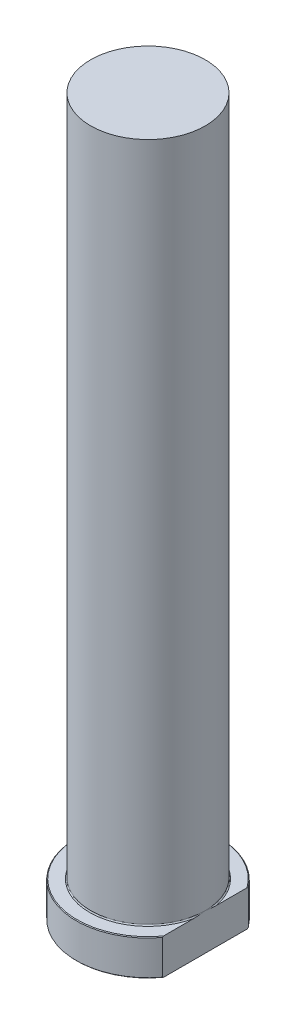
ISO-10303-21;
HEADER;
FILE_DESCRIPTION(('STEP AP214'),'2;1');
FILE_NAME('part.step','',(''),(''),'','','');
FILE_SCHEMA(('AUTOMOTIVE_DESIGN { 1 0 10303 214 1 1 1 1 }'));
ENDSEC;
DATA;
#1=APPLICATION_CONTEXT('core data for automotive mechanical design processes');
#2=APPLICATION_PROTOCOL_DEFINITION('international standard','automotive_design',2000,#1);
#3=PRODUCT_CONTEXT('',#1,'mechanical');
#4=PRODUCT('Part','Part','',(#3));
#5=PRODUCT_RELATED_PRODUCT_CATEGORY('part','',(#4));
#6=PRODUCT_DEFINITION_FORMATION('','',#4);
#7=PRODUCT_DEFINITION_CONTEXT('part definition',#1,'design');
#8=PRODUCT_DEFINITION('design','',#6,#7);
#9=PRODUCT_DEFINITION_SHAPE('','',#8);
#10=(LENGTH_UNIT() NAMED_UNIT(*) SI_UNIT(.MILLI.,.METRE.));
#11=(NAMED_UNIT(*) PLANE_ANGLE_UNIT() SI_UNIT($,.RADIAN.));
#12=(NAMED_UNIT(*) SI_UNIT($,.STERADIAN.) SOLID_ANGLE_UNIT());
#13=UNCERTAINTY_MEASURE_WITH_UNIT(LENGTH_MEASURE(1.E-05),#10,'distance_accuracy_value','');
#14=(GEOMETRIC_REPRESENTATION_CONTEXT(3) GLOBAL_UNCERTAINTY_ASSIGNED_CONTEXT((#13)) GLOBAL_UNIT_ASSIGNED_CONTEXT((#10,
#11,#12)) REPRESENTATION_CONTEXT('',''));
#15=CARTESIAN_POINT('',(0.,0.,0.));
#16=DIRECTION('',(0.,0.,1.));
#17=DIRECTION('',(1.,0.,0.));
#18=AXIS2_PLACEMENT_3D('',#15,#16,#17);
#19=CARTESIAN_POINT('',(0.,0.,0.));
#20=DIRECTION('',(0.,-1.,0.));
#21=DIRECTION('',(0.,0.,-1.));
#22=AXIS2_PLACEMENT_3D('',#19,#20,#21);
#23=PLANE('',#22);
#24=CARTESIAN_POINT('',(0.,0.,0.));
#25=DIRECTION('',(0.,-1.,0.));
#26=DIRECTION('',(0.,0.,-1.));
#27=AXIS2_PLACEMENT_3D('',#24,#25,#26);
#28=CIRCLE('',#27,19.8);
#29=CARTESIAN_POINT('',(16.,0.,11.6636186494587));
#30=VERTEX_POINT('',#29);
#31=CARTESIAN_POINT('',(16.,0.,-11.6636186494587));
#32=VERTEX_POINT('',#31);
#33=EDGE_CURVE('E98',#30,#32,#28,.T.);
#34=ORIENTED_EDGE('',*,*,#33,.T.);
#35=DIRECTION('',(0.,0.,1.));
#36=VECTOR('',#35,1.);
#37=CARTESIAN_POINT('',(16.,0.,-12.));
#38=LINE('',#37,#36);
#39=EDGE_CURVE('E83',#32,#30,#38,.T.);
#40=ORIENTED_EDGE('',*,*,#39,.T.);
#41=EDGE_LOOP('',(#34,#40));
#42=FACE_BOUND('',#41,.T.);
#43=ADVANCED_FACE('F32',(#42),#23,.T.);
#44=CARTESIAN_POINT('',(0.,259.958771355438,0.));
#45=DIRECTION('',(0.,1.,0.));
#46=DIRECTION('',(0.,0.,1.));
#47=AXIS2_PLACEMENT_3D('',#44,#45,#46);
#48=CYLINDRICAL_SURFACE('',#47,20.);
#49=CARTESIAN_POINT('',(0.,9.80000000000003,0.));
#50=DIRECTION('',(0.,1.,0.));
#51=DIRECTION('',(0.,0.,1.));
#52=AXIS2_PLACEMENT_3D('',#49,#50,#51);
#53=CIRCLE('',#52,20.);
#54=CARTESIAN_POINT('',(16.,9.80000000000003,12.));
#55=VERTEX_POINT('',#54);
#56=CARTESIAN_POINT('',(16.,9.80000000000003,-12.));
#57=VERTEX_POINT('',#56);
#58=EDGE_CURVE('E104',#55,#57,#53,.F.);
#59=ORIENTED_EDGE('',*,*,#58,.T.);
#60=DIRECTION('',(0.,-1.,0.));
#61=VECTOR('',#60,1.);
#62=CARTESIAN_POINT('',(16.,200.,-12.));
#63=LINE('',#62,#61);
#64=CARTESIAN_POINT('',(16.,0.199999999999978,-12.));
#65=VERTEX_POINT('',#64);
#66=EDGE_CURVE('E183',#57,#65,#63,.T.);
#67=ORIENTED_EDGE('',*,*,#66,.T.);
#68=CARTESIAN_POINT('',(0.,0.199999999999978,0.));
#69=DIRECTION('',(0.,-1.,0.));
#70=DIRECTION('',(0.,0.,-1.));
#71=AXIS2_PLACEMENT_3D('',#68,#69,#70);
#72=CIRCLE('',#71,20.);
#73=CARTESIAN_POINT('',(16.,0.199999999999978,12.));
#74=VERTEX_POINT('',#73);
#75=EDGE_CURVE('E100',#65,#74,#72,.F.);
#76=ORIENTED_EDGE('',*,*,#75,.T.);
#77=DIRECTION('',(0.,-1.,0.));
#78=VECTOR('',#77,1.);
#79=CARTESIAN_POINT('',(16.,200.,12.));
#80=LINE('',#79,#78);
#81=EDGE_CURVE('E93',#55,#74,#80,.T.);
#82=ORIENTED_EDGE('',*,*,#81,.F.);
#83=EDGE_LOOP('',(#59,#67,#76,#82));
#84=FACE_BOUND('',#83,.T.);
#85=ADVANCED_FACE('F158',(#84),#48,.T.);
#86=CARTESIAN_POINT('',(-20.,10.,0.));
#87=DIRECTION('',(0.,1.,0.));
#88=DIRECTION('',(0.,0.,1.));
#89=AXIS2_PLACEMENT_3D('',#86,#87,#88);
#90=PLANE('',#89);
#91=CARTESIAN_POINT('',(0.,10.,0.));
#92=DIRECTION('',(0.,1.,0.));
#93=DIRECTION('',(0.,0.,1.));
#94=AXIS2_PLACEMENT_3D('',#91,#92,#93);
#95=CIRCLE('',#94,19.8);
#96=CARTESIAN_POINT('',(16.,10.,-11.6636186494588));
#97=VERTEX_POINT('',#96);
#98=CARTESIAN_POINT('',(16.,10.,11.6636186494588));
#99=VERTEX_POINT('',#98);
#100=EDGE_CURVE('E178',#97,#99,#95,.T.);
#101=ORIENTED_EDGE('',*,*,#100,.T.);
#102=DIRECTION('',(0.,0.,-1.));
#103=VECTOR('',#102,1.);
#104=CARTESIAN_POINT('',(16.,10.,0.));
#105=LINE('',#104,#103);
#106=CARTESIAN_POINT('',(16.,10.,3.1128764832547));
#107=VERTEX_POINT('',#106);
#108=EDGE_CURVE('E57',#99,#107,#105,.T.);
#109=ORIENTED_EDGE('',*,*,#108,.T.);
#110=CARTESIAN_POINT('',(0.,10.,0.));
#111=DIRECTION('',(0.,1.,0.));
#112=DIRECTION('',(0.,0.,1.));
#113=AXIS2_PLACEMENT_3D('',#110,#111,#112);
#114=CIRCLE('',#113,16.3);
#115=CARTESIAN_POINT('',(16.,10.,-3.11287648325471));
#116=VERTEX_POINT('',#115);
#117=EDGE_CURVE('E107',#107,#116,#114,.F.);
#118=ORIENTED_EDGE('',*,*,#117,.T.);
#119=EDGE_CURVE('E136',#116,#97,#105,.T.);
#120=ORIENTED_EDGE('',*,*,#119,.T.);
#121=EDGE_LOOP('',(#101,#109,#118,#120));
#122=FACE_BOUND('',#121,.T.);
#123=ADVANCED_FACE('F147',(#122),#90,.T.);
#124=CARTESIAN_POINT('',(0.,10.,0.));
#125=DIRECTION('',(0.,-1.,0.));
#126=DIRECTION('',(0.,0.,-1.));
#127=AXIS2_PLACEMENT_3D('',#124,#125,#126);
#128=CONICAL_SURFACE('',#127,19.8,0.785398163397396);
#129=ORIENTED_EDGE('',*,*,#58,.F.);
#130=CARTESIAN_POINT('',(16.,-1.07064884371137,26.4006999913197));
#131=CARTESIAN_POINT('',(16.,-0.7331562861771,26.0060486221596));
#132=CARTESIAN_POINT('',(16.,-0.396819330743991,25.6104050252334));
#133=CARTESIAN_POINT('',(16.,0.273206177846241,24.8168690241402));
#134=CARTESIAN_POINT('',(16.,0.606894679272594,24.4189765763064));
#135=CARTESIAN_POINT('',(16.,1.27144329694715,23.6204891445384));
#136=CARTESIAN_POINT('',(16.,1.60230187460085,23.2198928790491));
#137=CARTESIAN_POINT('',(16.,2.26059114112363,22.4158945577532));
#138=CARTESIAN_POINT('',(16.,2.58802184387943,22.0124925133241));
#139=CARTESIAN_POINT('',(16.,3.2476674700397,21.1916872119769));
#140=CARTESIAN_POINT('',(16.,3.57977582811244,20.7741982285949));
#141=CARTESIAN_POINT('',(16.,4.23919239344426,19.9354474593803));
#142=CARTESIAN_POINT('',(16.,4.56650063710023,19.514185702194));
#143=CARTESIAN_POINT('',(16.,5.21544461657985,18.6674666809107));
#144=CARTESIAN_POINT('',(16.,5.53708166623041,18.2420104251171));
#145=CARTESIAN_POINT('',(16.,6.17378218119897,17.3861997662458));
#146=CARTESIAN_POINT('',(16.,6.48884565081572,16.9558453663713));
#147=CARTESIAN_POINT('',(16.,7.11176935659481,16.0887218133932));
#148=CARTESIAN_POINT('',(16.,7.419615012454,15.6519421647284));
#149=CARTESIAN_POINT('',(16.,8.02597466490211,14.771929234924));
#150=CARTESIAN_POINT('',(16.,8.32448855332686,14.328695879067));
#151=CARTESIAN_POINT('',(16.,8.9105299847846,13.434438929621));
#152=CARTESIAN_POINT('',(16.,9.19804754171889,12.9834087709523));
#153=CARTESIAN_POINT('',(16.,9.75938980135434,12.0728858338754));
#154=CARTESIAN_POINT('',(16.,10.0332147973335,11.6133932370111));
#155=CARTESIAN_POINT('',(16.,10.5615335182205,10.6892898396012));
#156=CARTESIAN_POINT('',(16.,10.8161891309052,10.2247720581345));
#157=CARTESIAN_POINT('',(16.,11.3053445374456,9.28510847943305));
#158=CARTESIAN_POINT('',(16.,11.539841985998,8.8099614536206));
#159=CARTESIAN_POINT('',(16.,11.98362780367,7.84885100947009));
#160=CARTESIAN_POINT('',(16.,12.1929556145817,7.36290596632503));
#161=CARTESIAN_POINT('',(16.,12.581143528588,6.37912337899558));
#162=CARTESIAN_POINT('',(16.,12.7600157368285,5.88129064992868));
#163=CARTESIAN_POINT('',(16.,13.0861366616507,4.85753764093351));
#164=CARTESIAN_POINT('',(16.,13.2321910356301,4.33122827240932));
#165=CARTESIAN_POINT('',(16.,13.4164504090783,3.53379728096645));
#166=CARTESIAN_POINT('',(16.,13.4720698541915,3.26663533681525));
#167=CARTESIAN_POINT('',(16.,13.570901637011,2.73003918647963));
#168=CARTESIAN_POINT('',(16.,13.6141156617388,2.46060529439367));
#169=CARTESIAN_POINT('',(16.,13.6872774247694,1.92117630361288));
#170=CARTESIAN_POINT('',(16.,13.7172841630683,1.65118922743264));
#171=CARTESIAN_POINT('',(16.,13.7638048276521,1.11005042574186));
#172=CARTESIAN_POINT('',(16.,13.7803188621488,0.838898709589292));
#173=CARTESIAN_POINT('',(16.,13.7995586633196,0.296109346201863));
#174=CARTESIAN_POINT('',(16.,13.8022847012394,0.0244717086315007));
#175=CARTESIAN_POINT('',(16.,13.7939006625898,-0.518588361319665));
#176=CARTESIAN_POINT('',(16.,13.7827905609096,-0.790010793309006));
#177=CARTESIAN_POINT('',(16.,13.7469663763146,-1.33142514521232));
#178=CARTESIAN_POINT('',(16.,13.7222788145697,-1.60141882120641));
#179=CARTESIAN_POINT('',(16.,13.6597540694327,-2.13989179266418));
#180=CARTESIAN_POINT('',(16.,13.6219151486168,-2.40837088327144));
#181=CARTESIAN_POINT('',(16.,13.4895557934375,-3.21066813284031));
#182=CARTESIAN_POINT('',(16.,13.376185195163,-3.74145456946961));
#183=CARTESIAN_POINT('',(16.,13.1048507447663,-4.79469191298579));
#184=CARTESIAN_POINT('',(16.,12.9466209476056,-5.31707285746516));
#185=CARTESIAN_POINT('',(16.,12.6815624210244,-6.09095035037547));
#186=CARTESIAN_POINT('',(16.,12.5885858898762,-6.34730496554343));
#187=CARTESIAN_POINT('',(16.,12.394238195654,-6.85681818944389));
#188=CARTESIAN_POINT('',(16.,12.2928668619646,-7.10997673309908));
#189=CARTESIAN_POINT('',(16.,11.908773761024,-8.02895093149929));
#190=CARTESIAN_POINT('',(16.,11.603220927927,-8.6852850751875));
#191=CARTESIAN_POINT('',(16.,10.9520387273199,-9.97785473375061));
#192=CARTESIAN_POINT('',(16.,10.6063845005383,-10.614077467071));
#193=CARTESIAN_POINT('',(16.,9.88410853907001,-11.8704402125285));
#194=CARTESIAN_POINT('',(16.,9.5074202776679,-12.4905417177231));
#195=CARTESIAN_POINT('',(16.,8.73104614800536,-13.7158784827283));
#196=CARTESIAN_POINT('',(16.,8.33136526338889,-14.3211169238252));
#197=CARTESIAN_POINT('',(16.,7.51225576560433,-15.5221520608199));
#198=CARTESIAN_POINT('',(16.,7.09274396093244,-16.1178917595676));
#199=CARTESIAN_POINT('',(16.,6.23957009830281,-17.2991512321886));
#200=CARTESIAN_POINT('',(16.,5.80590743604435,-17.8846705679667));
#201=CARTESIAN_POINT('',(16.,4.92783508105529,-19.0464967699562));
#202=CARTESIAN_POINT('',(16.,4.48343853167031,-19.6228135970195));
#203=CARTESIAN_POINT('',(16.,3.58557777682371,-20.7683027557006));
#204=CARTESIAN_POINT('',(16.,3.13211380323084,-21.3374752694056));
#205=CARTESIAN_POINT('',(16.,2.36744022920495,-22.2844266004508));
#206=CARTESIAN_POINT('',(16.,2.05826684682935,-22.6638539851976));
#207=CARTESIAN_POINT('',(16.,1.43690833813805,-23.4203229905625));
#208=CARTESIAN_POINT('',(16.,1.12472279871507,-23.7973642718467));
#209=CARTESIAN_POINT('',(16.,0.499956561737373,-24.5465888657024));
#210=CARTESIAN_POINT('',(16.,0.187394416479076,-24.9187876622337));
#211=CARTESIAN_POINT('',(16.,-0.439990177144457,-25.6611808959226));
#212=CARTESIAN_POINT('',(16.,-0.754812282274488,-26.0313756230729));
#213=CARTESIAN_POINT('',(16.,-1.07064884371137,-26.4006999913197));
#214=B_SPLINE_CURVE_WITH_KNOTS('',3,(#130,#131,#132,#133,#134,#135,#136,#137,#138,#139,#140,
#141,#142,#143,#144,#145,#146,#147,#148,#149,#150,#151,#152,#153,#154,#155,#156,#157,#158,#159,
#160,#161,#162,#163,#164,#165,#166,#167,#168,#169,#170,#171,#172,#173,#174,#175,#176,#177,#178,
#179,#180,#181,#182,#183,#184,#185,#186,#187,#188,#189,#190,#191,#192,#193,#194,#195,#196,#197,
#198,#199,#200,#201,#202,#203,#204,#205,#206,#207,#208,#209,#210,#211,#212,#213),.UNSPECIFIED.,
.F.,.F.,(4,2,2,2,2,2,2,2,2,2,2,2,2,2,2,2,2,2,2,2,2,2,2,2,2,2,2,2,2,2,2,2,2,2,2,2,2,2,2,2,2,4),
(0.,1.55783999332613,3.11571034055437,4.67437978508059,6.23304291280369,7.83343038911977,
9.43380572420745,11.0338053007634,12.6338038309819,14.236795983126,15.83980670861,
17.4442401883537,19.0486392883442,20.6374598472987,22.2264650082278,23.81294675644,
25.3987964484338,27.0353648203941,27.8537926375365,28.6721091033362,29.4867319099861,
30.3013481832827,31.1159484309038,31.9305501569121,32.743566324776,33.5566899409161,
35.1826128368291,36.818384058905,37.6363419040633,38.4543163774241,40.6241539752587,
42.7953439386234,44.9713157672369,47.1468177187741,49.3324366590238,51.5181490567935,
53.7013086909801,55.8844125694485,57.3527237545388,58.8212392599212,60.2793254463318,
61.7371946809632),.UNSPECIFIED.);
#215=EDGE_CURVE('E135',#55,#99,#214,.T.);
#216=ORIENTED_EDGE('',*,*,#215,.T.);
#217=ORIENTED_EDGE('',*,*,#100,.F.);
#218=EDGE_CURVE('E127',#97,#57,#214,.T.);
#219=ORIENTED_EDGE('',*,*,#218,.T.);
#220=EDGE_LOOP('',(#129,#216,#217,#219));
#221=FACE_BOUND('',#220,.T.);
#222=ADVANCED_FACE('F143',(#221),#128,.T.);
#223=CARTESIAN_POINT('',(0.,0.199999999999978,0.));
#224=DIRECTION('',(0.,1.,0.));
#225=DIRECTION('',(0.,0.,1.));
#226=AXIS2_PLACEMENT_3D('',#223,#224,#225);
#227=CONICAL_SURFACE('',#226,20.,0.785398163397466);
#228=ORIENTED_EDGE('',*,*,#75,.F.);
#229=CARTESIAN_POINT('',(16.,11.0706488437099,-26.4006999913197));
#230=CARTESIAN_POINT('',(16.,10.7331562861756,-26.0060486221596));
#231=CARTESIAN_POINT('',(16.,10.3968193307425,-25.6104050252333));
#232=CARTESIAN_POINT('',(16.,9.72679382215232,-24.8168690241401));
#233=CARTESIAN_POINT('',(16.,9.39310532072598,-24.4189765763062));
#234=CARTESIAN_POINT('',(16.,8.72855670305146,-23.6204891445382));
#235=CARTESIAN_POINT('',(16.,8.39769812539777,-23.2198928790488));
#236=CARTESIAN_POINT('',(16.,7.73940885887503,-22.4158945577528));
#237=CARTESIAN_POINT('',(16.,7.41197815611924,-22.0124925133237));
#238=CARTESIAN_POINT('',(16.,6.752332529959,-21.1916872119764));
#239=CARTESIAN_POINT('',(16.,6.42022417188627,-20.7741982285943));
#240=CARTESIAN_POINT('',(16.,5.76080760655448,-19.9354474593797));
#241=CARTESIAN_POINT('',(16.,5.43349936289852,-19.5141857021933));
#242=CARTESIAN_POINT('',(16.,4.78455538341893,-18.6674666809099));
#243=CARTESIAN_POINT('',(16.,4.46291833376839,-18.2420104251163));
#244=CARTESIAN_POINT('',(16.,3.82621781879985,-17.3861997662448));
#245=CARTESIAN_POINT('',(16.,3.51115434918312,-16.9558453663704));
#246=CARTESIAN_POINT('',(16.,2.88823064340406,-16.0887218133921));
#247=CARTESIAN_POINT('',(16.,2.58038498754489,-15.6519421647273));
#248=CARTESIAN_POINT('',(16.,1.97402533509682,-14.7719292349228));
#249=CARTESIAN_POINT('',(16.,1.6755114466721,-14.3286958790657));
#250=CARTESIAN_POINT('',(16.,1.08947001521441,-13.4344389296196));
#251=CARTESIAN_POINT('',(16.,0.801952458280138,-12.9834087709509));
#252=CARTESIAN_POINT('',(16.,0.240610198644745,-12.0728858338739));
#253=CARTESIAN_POINT('',(16.,-0.0332147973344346,-11.6133932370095));
#254=CARTESIAN_POINT('',(16.,-0.561533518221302,-10.6892898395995));
#255=CARTESIAN_POINT('',(16.,-0.816189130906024,-10.2247720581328));
#256=CARTESIAN_POINT('',(16.,-1.30534453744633,-9.28510847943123));
#257=CARTESIAN_POINT('',(16.,-1.5398419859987,-8.80996145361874));
#258=CARTESIAN_POINT('',(16.,-1.98362780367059,-7.84885100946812));
#259=CARTESIAN_POINT('',(16.,-2.19295561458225,-7.36290596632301));
#260=CARTESIAN_POINT('',(16.,-2.58114352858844,-6.37912337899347));
#261=CARTESIAN_POINT('',(16.,-2.76001573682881,-5.88129064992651));
#262=CARTESIAN_POINT('',(16.,-3.08613666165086,-4.85753764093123));
#263=CARTESIAN_POINT('',(16.,-3.23219103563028,-4.33122827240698));
#264=CARTESIAN_POINT('',(16.,-3.41645040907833,-3.53379728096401));
#265=CARTESIAN_POINT('',(16.,-3.47206985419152,-3.26663533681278));
#266=CARTESIAN_POINT('',(16.,-3.57090163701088,-2.7300391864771));
#267=CARTESIAN_POINT('',(16.,-3.61411566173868,-2.46060529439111));
#268=CARTESIAN_POINT('',(16.,-3.6872774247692,-1.92117630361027));
#269=CARTESIAN_POINT('',(16.,-3.71728416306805,-1.65118922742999));
#270=CARTESIAN_POINT('',(16.,-3.76380482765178,-1.11005042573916));
#271=CARTESIAN_POINT('',(16.,-3.78031886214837,-0.838898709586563));
#272=CARTESIAN_POINT('',(16.,-3.79955866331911,-0.296109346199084));
#273=CARTESIAN_POINT('',(16.,-3.80228470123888,-0.0244717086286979));
#274=CARTESIAN_POINT('',(16.,-3.79390066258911,0.518588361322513));
#275=CARTESIAN_POINT('',(16.,-3.78279056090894,0.790010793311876));
#276=CARTESIAN_POINT('',(16.,-3.74696637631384,1.33142514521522));
#277=CARTESIAN_POINT('',(16.,-3.7222788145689,1.60141882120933));
#278=CARTESIAN_POINT('',(16.,-3.65975406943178,2.13989179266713));
#279=CARTESIAN_POINT('',(16.,-3.62191514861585,2.40837088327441));
#280=CARTESIAN_POINT('',(16.,-3.48955579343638,3.21066813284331));
#281=CARTESIAN_POINT('',(16.,-3.37618519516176,3.74145456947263));
#282=CARTESIAN_POINT('',(16.,-3.10485074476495,4.79469191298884));
#283=CARTESIAN_POINT('',(16.,-2.94662094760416,5.31707285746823));
#284=CARTESIAN_POINT('',(16.,-2.68156242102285,6.09095035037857));
#285=CARTESIAN_POINT('',(16.,-2.58858588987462,6.34730496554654));
#286=CARTESIAN_POINT('',(16.,-2.39423819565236,6.85681818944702));
#287=CARTESIAN_POINT('',(16.,-2.29286686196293,7.10997673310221));
#288=CARTESIAN_POINT('',(16.,-1.90877376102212,8.0289509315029));
#289=CARTESIAN_POINT('',(16.,-1.6032209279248,8.68528507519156));
#290=CARTESIAN_POINT('',(16.,-0.952038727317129,9.97785473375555));
#291=CARTESIAN_POINT('',(16.,-0.606384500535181,10.6140774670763));
#292=CARTESIAN_POINT('',(16.,0.115891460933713,11.8704402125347));
#293=CARTESIAN_POINT('',(16.,0.492579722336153,12.4905417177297));
#294=CARTESIAN_POINT('',(16.,1.26895385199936,13.7158784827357));
#295=CARTESIAN_POINT('',(16.,1.66863473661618,14.3211169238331));
#296=CARTESIAN_POINT('',(16.,2.48774423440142,15.5221520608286));
#297=CARTESIAN_POINT('',(16.,2.90725603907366,16.1178917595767));
#298=CARTESIAN_POINT('',(16.,3.76042990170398,17.2991512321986));
#299=CARTESIAN_POINT('',(16.,4.19409256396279,17.884670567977));
#300=CARTESIAN_POINT('',(16.,5.07216491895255,19.0464967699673));
#301=CARTESIAN_POINT('',(16.,5.51656146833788,19.622813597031));
#302=CARTESIAN_POINT('',(16.,6.41442222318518,20.7683027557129));
#303=CARTESIAN_POINT('',(16.,6.8678861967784,21.3374752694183));
#304=CARTESIAN_POINT('',(16.,7.63255977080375,22.2844266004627));
#305=CARTESIAN_POINT('',(16.,7.94173315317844,22.6638539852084));
#306=CARTESIAN_POINT('',(16.,8.56309166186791,23.4203229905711));
#307=CARTESIAN_POINT('',(16.,8.87527720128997,23.7973642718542));
#308=CARTESIAN_POINT('',(16.,9.50004343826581,24.5465888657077));
#309=CARTESIAN_POINT('',(16.,9.81260558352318,24.918787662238));
#310=CARTESIAN_POINT('',(16.,10.4399901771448,25.6611808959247));
#311=CARTESIAN_POINT('',(16.,10.7548122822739,26.031375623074));
#312=CARTESIAN_POINT('',(16.,11.0706488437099,26.4006999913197));
#313=B_SPLINE_CURVE_WITH_KNOTS('',3,(#229,#230,#231,#232,#233,#234,#235,#236,#237,#238,#239,
#240,#241,#242,#243,#244,#245,#246,#247,#248,#249,#250,#251,#252,#253,#254,#255,#256,#257,#258,
#259,#260,#261,#262,#263,#264,#265,#266,#267,#268,#269,#270,#271,#272,#273,#274,#275,#276,#277,
#278,#279,#280,#281,#282,#283,#284,#285,#286,#287,#288,#289,#290,#291,#292,#293,#294,#295,#296,
#297,#298,#299,#300,#301,#302,#303,#304,#305,#306,#307,#308,#309,#310,#311,#312),.UNSPECIFIED.,
.F.,.F.,(4,2,2,2,2,2,2,2,2,2,2,2,2,2,2,2,2,2,2,2,2,2,2,2,2,2,2,2,2,2,2,2,2,2,2,2,2,2,2,2,2,4),
(0.,1.55783999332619,3.11571034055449,4.67437978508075,6.23304291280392,7.83343038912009,
9.43380572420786,11.0338053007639,12.6338038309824,14.2367959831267,15.8398067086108,
17.4442401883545,19.0486392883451,20.6374598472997,22.2264650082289,23.8129467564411,
25.398796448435,27.0353648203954,27.853792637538,28.6721091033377,29.4867319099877,
30.3013481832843,31.1159484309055,31.9305501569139,32.7435663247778,33.556689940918,
35.1826128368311,36.8183840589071,37.6363419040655,38.4543163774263,40.6241539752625,
42.7953439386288,44.9713157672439,47.1468177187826,49.3324366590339,51.5181490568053,
53.7013086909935,55.8844125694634,57.3527237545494,58.8212392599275,60.2793254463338,
61.737194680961),.UNSPECIFIED.);
#314=EDGE_CURVE('E86',#65,#32,#313,.T.);
#315=ORIENTED_EDGE('',*,*,#314,.T.);
#316=ORIENTED_EDGE('',*,*,#33,.F.);
#317=EDGE_CURVE('E89',#30,#74,#313,.T.);
#318=ORIENTED_EDGE('',*,*,#317,.T.);
#319=EDGE_LOOP('',(#228,#315,#316,#318));
#320=FACE_BOUND('',#319,.T.);
#321=ADVANCED_FACE('F97',(#320),#227,.T.);
#322=CARTESIAN_POINT('',(0.,10.3,0.));
#323=DIRECTION('',(0.,1.,0.));
#324=DIRECTION('',(0.,0.,1.));
#325=AXIS2_PLACEMENT_3D('',#322,#323,#324);
#326=TOROIDAL_SURFACE('',#325,16.3,0.3);
#327=CARTESIAN_POINT('',(16.,10.3,0.));
#328=CARTESIAN_POINT('',(16.,10.3000006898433,-5.33715911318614E-09));
#329=CARTESIAN_POINT('',(16.,10.3000013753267,-5.90477996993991E-07));
#330=CARTESIAN_POINT('',(16.,10.3000026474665,-1.99315110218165E-06));
#331=CARTESIAN_POINT('',(16.,10.3000031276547,-2.82387138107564E-06));
#332=CARTESIAN_POINT('',(16.,10.300004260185,-4.93201352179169E-06));
#333=CARTESIAN_POINT('',(16.,10.300004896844,-6.24688723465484E-06));
#334=CARTESIAN_POINT('',(16.,10.3000059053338,-8.79561581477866E-06));
#335=CARTESIAN_POINT('',(16.,10.3000062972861,-1.00244169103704E-05));
#336=CARTESIAN_POINT('',(16.,10.3000079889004,-1.53269558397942E-05));
#337=CARTESIAN_POINT('',(16.,10.3000092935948,-1.94146126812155E-05));
#338=CARTESIAN_POINT('',(16.,10.3000111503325,-2.70530674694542E-05));
#339=CARTESIAN_POINT('',(16.,10.300011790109,-3.05834546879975E-05));
#340=CARTESIAN_POINT('',(16.,10.3000164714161,-5.69924666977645E-05));
#341=CARTESIAN_POINT('',(16.,10.3000199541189,-7.99464318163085E-05));
#342=CARTESIAN_POINT('',(16.,10.3000322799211,-0.000171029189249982));
#343=CARTESIAN_POINT('',(16.,10.3000382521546,-0.000239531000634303));
#344=CARTESIAN_POINT('',(16.,10.3000656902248,-0.00050618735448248));
#345=CARTESIAN_POINT('',(16.,10.3000950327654,-0.0007033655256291));
#346=CARTESIAN_POINT('',(16.,10.3002038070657,-0.0014556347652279));
#347=CARTESIAN_POINT('',(16.,10.300277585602,-0.00201139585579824));
#348=CARTESIAN_POINT('',(16.,10.3005644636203,-0.00414914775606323));
#349=CARTESIAN_POINT('',(16.,10.300783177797,-0.00573048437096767));
#350=CARTESIAN_POINT('',(16.,10.3018172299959,-0.0132287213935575));
#351=CARTESIAN_POINT('',(16.,10.3026243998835,-0.0191465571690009));
#352=CARTESIAN_POINT('',(16.,10.3110865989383,-0.0811528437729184));
#353=CARTESIAN_POINT('',(16.,10.3187815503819,-0.137236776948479));
#354=CARTESIAN_POINT('',(16.,10.3348868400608,-0.255096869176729));
#355=CARTESIAN_POINT('',(16.,10.343290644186,-0.316873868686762));
#356=CARTESIAN_POINT('',(16.,10.3571569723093,-0.419331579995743));
#357=CARTESIAN_POINT('',(16.,10.3626434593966,-0.460008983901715));
#358=CARTESIAN_POINT('',(16.,10.3734224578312,-0.540334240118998));
#359=CARTESIAN_POINT('',(16.,10.3787163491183,-0.579981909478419));
#360=CARTESIAN_POINT('',(16.,10.4083966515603,-0.803619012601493));
#361=CARTESIAN_POINT('',(16.,10.4321379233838,-0.987696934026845));
#362=CARTESIAN_POINT('',(16.,10.4771585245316,-1.35808125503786));
#363=CARTESIAN_POINT('',(16.,10.4984099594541,-1.54439106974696));
#364=CARTESIAN_POINT('',(16.,10.5392977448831,-1.94430528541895));
#365=CARTESIAN_POINT('',(16.,10.5582626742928,-2.15798298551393));
#366=CARTESIAN_POINT('',(16.,10.5798230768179,-2.47853128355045));
#367=CARTESIAN_POINT('',(16.,10.5858566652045,-2.58516682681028));
#368=CARTESIAN_POINT('',(16.,10.5950189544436,-2.79855398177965));
#369=CARTESIAN_POINT('',(16.,10.5981480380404,-2.90530557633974));
#370=CARTESIAN_POINT('',(16.,10.6006064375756,-3.11480969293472));
#371=CARTESIAN_POINT('',(16.,10.600075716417,-3.21755992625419));
#372=CARTESIAN_POINT('',(16.,10.5957602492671,-3.37181907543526));
#373=CARTESIAN_POINT('',(16.,10.593726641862,-3.42337702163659));
#374=CARTESIAN_POINT('',(16.,10.5882429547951,-3.52640582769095));
#375=CARTESIAN_POINT('',(16.,10.584793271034,-3.57787670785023));
#376=CARTESIAN_POINT('',(16.,10.5763123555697,-3.67890194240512));
#377=CARTESIAN_POINT('',(16.,10.5713398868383,-3.72846106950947));
#378=CARTESIAN_POINT('',(16.,10.5593485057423,-3.82738811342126));
#379=CARTESIAN_POINT('',(16.,10.5523274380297,-3.87675577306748));
#380=CARTESIAN_POINT('',(16.,10.5356271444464,-3.97473922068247));
#381=CARTESIAN_POINT('',(16.,10.5259654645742,-4.02335780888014));
#382=CARTESIAN_POINT('',(16.,10.5085240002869,-4.09553189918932));
#383=CARTESIAN_POINT('',(16.,10.5022253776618,-4.11944402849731));
#384=CARTESIAN_POINT('',(16.,10.4883597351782,-4.16689390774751));
#385=CARTESIAN_POINT('',(16.,10.4807934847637,-4.19043187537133));
#386=CARTESIAN_POINT('',(16.,10.468072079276,-4.22548932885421));
#387=CARTESIAN_POINT('',(16.,10.463554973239,-4.23724015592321));
#388=CARTESIAN_POINT('',(16.,10.4539723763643,-4.2605292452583));
#389=CARTESIAN_POINT('',(16.,10.4489064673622,-4.27206733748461));
#390=CARTESIAN_POINT('',(16.,10.4380905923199,-4.29485009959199));
#391=CARTESIAN_POINT('',(16.,10.4323392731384,-4.30609413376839));
#392=CARTESIAN_POINT('',(16.,10.4199753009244,-4.32809262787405));
#393=CARTESIAN_POINT('',(16.,10.4133636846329,-4.33884765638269));
#394=CARTESIAN_POINT('',(16.,10.3989169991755,-4.35969720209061));
#395=CARTESIAN_POINT('',(16.,10.3910687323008,-4.36978269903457));
#396=CARTESIAN_POINT('',(16.,10.3737930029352,-4.38847604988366));
#397=CARTESIAN_POINT('',(16.,10.3643793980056,-4.39709563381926));
#398=CARTESIAN_POINT('',(16.,10.349684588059,-4.40721260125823));
#399=CARTESIAN_POINT('',(16.,10.3452411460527,-4.40991204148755));
#400=CARTESIAN_POINT('',(16.,10.3360120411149,-4.41465735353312));
#401=CARTESIAN_POINT('',(16.,10.331226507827,-4.41670347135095));
#402=CARTESIAN_POINT('',(16.,10.321316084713,-4.41997867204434));
#403=CARTESIAN_POINT('',(16.,10.3161880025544,-4.42119837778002));
#404=CARTESIAN_POINT('',(16.,10.3057936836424,-4.42262740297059));
#405=CARTESIAN_POINT('',(16.,10.3005276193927,-4.42283792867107));
#406=CARTESIAN_POINT('',(16.,10.2906214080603,-4.42225569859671));
#407=CARTESIAN_POINT('',(16.,10.285974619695,-4.42156796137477));
#408=CARTESIAN_POINT('',(16.,10.2768560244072,-4.41944337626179));
#409=CARTESIAN_POINT('',(16.,10.2723843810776,-4.41800584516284));
#410=CARTESIAN_POINT('',(16.,10.2619701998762,-4.41381248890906));
#411=CARTESIAN_POINT('',(16.,10.2561483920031,-4.4107598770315));
#412=CARTESIAN_POINT('',(16.,10.2450526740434,-4.40378684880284));
#413=CARTESIAN_POINT('',(16.,10.239780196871,-4.39986424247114));
#414=CARTESIAN_POINT('',(16.,10.2257729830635,-4.38808908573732));
#415=CARTESIAN_POINT('',(16.,10.2175965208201,-4.37958133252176));
#416=CARTESIAN_POINT('',(16.,10.2024790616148,-4.36154434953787));
#417=CARTESIAN_POINT('',(16.,10.1955419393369,-4.35201206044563));
#418=CARTESIAN_POINT('',(16.,10.1791886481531,-4.32717029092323));
#419=CARTESIAN_POINT('',(16.,10.1703884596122,-4.31145991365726));
#420=CARTESIAN_POINT('',(16.,10.154248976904,-4.2792945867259));
#421=CARTESIAN_POINT('',(16.,10.1469131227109,-4.26283799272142));
#422=CARTESIAN_POINT('',(16.,10.1332947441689,-4.22939871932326));
#423=CARTESIAN_POINT('',(16.,10.1270179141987,-4.2124137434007));
#424=CARTESIAN_POINT('',(16.,10.1153239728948,-4.17817736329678));
#425=CARTESIAN_POINT('',(16.,10.1099058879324,-4.16092628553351));
#426=CARTESIAN_POINT('',(16.,10.0949674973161,-4.10989946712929));
#427=CARTESIAN_POINT('',(16.,10.0863847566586,-4.07584989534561));
#428=CARTESIAN_POINT('',(16.,10.0710343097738,-4.00733871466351));
#429=CARTESIAN_POINT('',(16.,10.0642677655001,-3.97287685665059));
#430=CARTESIAN_POINT('',(16.,10.0460186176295,-3.86898411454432));
#431=CARTESIAN_POINT('',(16.,10.036623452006,-3.79918851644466));
#432=CARTESIAN_POINT('',(16.,10.0215249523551,-3.65915321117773));
#433=CARTESIAN_POINT('',(16.,10.0158261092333,-3.58891306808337));
#434=CARTESIAN_POINT('',(16.,10.0072116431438,-3.44836432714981));
#435=CARTESIAN_POINT('',(16.,10.00429218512,-3.37805595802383));
#436=CARTESIAN_POINT('',(16.,10.000668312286,-3.23904020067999));
#437=CARTESIAN_POINT('',(16.,9.99991350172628,-3.17033397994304));
#438=CARTESIAN_POINT('',(16.,10.0001018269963,-3.03292208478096));
#439=CARTESIAN_POINT('',(16.,10.0010450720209,-2.96421641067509));
#440=CARTESIAN_POINT('',(16.,10.0059904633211,-2.75810886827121));
#441=CARTESIAN_POINT('',(16.,10.0121089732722,-2.62075798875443));
#442=CARTESIAN_POINT('',(16.,10.0284391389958,-2.34612718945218));
#443=CARTESIAN_POINT('',(16.,10.0386564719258,-2.20884763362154));
#444=CARTESIAN_POINT('',(16.,10.0621466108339,-1.93454208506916));
#445=CARTESIAN_POINT('',(16.,10.075419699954,-1.79751611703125));
#446=CARTESIAN_POINT('',(16.,10.118522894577,-1.38740066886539));
#447=CARTESIAN_POINT('',(16.,10.1516806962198,-1.11466812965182));
#448=CARTESIAN_POINT('',(16.,10.2220528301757,-0.569702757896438));
#449=CARTESIAN_POINT('',(16.,10.259267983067,-0.297470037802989));
#450=CARTESIAN_POINT('',(16.,10.2965515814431,-0.0251841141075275));
#451=CARTESIAN_POINT('',(16.,10.2965597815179,-0.0251242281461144));
#452=CARTESIAN_POINT('',(16.,10.2972621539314,-0.019994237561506));
#453=CARTESIAN_POINT('',(16.,10.2979507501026,-0.0149234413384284));
#454=CARTESIAN_POINT('',(16.,10.2989595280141,-0.00761717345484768));
#455=CARTESIAN_POINT('',(16.,10.2992705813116,-0.00538056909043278));
#456=CARTESIAN_POINT('',(16.,10.2996656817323,-0.00242425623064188));
#457=CARTESIAN_POINT('',(16.,10.2997604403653,-0.00170587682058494));
#458=CARTESIAN_POINT('',(16.,10.2998960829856,-0.000765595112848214));
#459=CARTESIAN_POINT('',(16.,10.2999290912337,-0.000542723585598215));
#460=CARTESIAN_POINT('',(16.,10.2999593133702,-0.000246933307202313));
#461=CARTESIAN_POINT('',(16.,10.2999656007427,-0.000175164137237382));
#462=CARTESIAN_POINT('',(16.,10.2999790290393,-8.05668880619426E-05));
#463=CARTESIAN_POINT('',(16.,10.2999827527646,-5.72823548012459E-05));
#464=CARTESIAN_POINT('',(16.,10.2999877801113,-3.05492734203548E-05));
#465=CARTESIAN_POINT('',(16.,10.2999884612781,-2.70084595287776E-05));
#466=CARTESIAN_POINT('',(16.,10.2999904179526,-1.93523012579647E-05));
#467=CARTESIAN_POINT('',(16.,10.2999917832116,-1.52589672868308E-05));
#468=CARTESIAN_POINT('',(16.,10.2999935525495,-9.95362422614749E-06));
#469=CARTESIAN_POINT('',(16.,10.2999939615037,-8.72734435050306E-06));
#470=CARTESIAN_POINT('',(16.,10.2999950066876,-6.18658496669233E-06));
#471=CARTESIAN_POINT('',(16.,10.2999956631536,-4.87748836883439E-06));
#472=CARTESIAN_POINT('',(16.,10.2999968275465,-2.7813010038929E-06));
#473=CARTESIAN_POINT('',(16.,10.2999973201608,-1.95628425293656E-06));
#474=CARTESIAN_POINT('',(16.,10.2999986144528,-5.7037197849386E-07));
#475=CARTESIAN_POINT('',(16.,10.299999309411,5.3429283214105E-09));
#476=CARTESIAN_POINT('',(16.,10.3,0.));
#477=B_SPLINE_CURVE_WITH_KNOTS('',3,(#327,#328,#329,#330,#331,#332,#333,#334,#335,#336,#337,
#338,#339,#340,#341,#342,#343,#344,#345,#346,#347,#348,#349,#350,#351,#352,#353,#354,#355,#356,
#357,#358,#359,#360,#361,#362,#363,#364,#365,#366,#367,#368,#369,#370,#371,#372,#373,#374,#375,
#376,#377,#378,#379,#380,#381,#382,#383,#384,#385,#386,#387,#388,#389,#390,#391,#392,#393,#394,
#395,#396,#397,#398,#399,#400,#401,#402,#403,#404,#405,#406,#407,#408,#409,#410,#411,#412,#413,
#414,#415,#416,#417,#418,#419,#420,#421,#422,#423,#424,#425,#426,#427,#428,#429,#430,#431,#432,
#433,#434,#435,#436,#437,#438,#439,#440,#441,#442,#443,#444,#445,#446,#447,#448,#449,#450,#451,
#452,#453,#454,#455,#456,#457,#458,#459,#460,#461,#462,#463,#464,#465,#466,#467,#468,#469,#470,
#471,#472,#473,#474,#475,#476),.UNSPECIFIED.,.T.,.F.,(4,2,2,2,2,2,2,2,2,2,2,2,2,2,2,2,2,2,2,2,2,
2,2,2,2,2,2,2,2,2,2,2,2,2,2,2,2,2,2,2,2,2,2,2,2,2,2,2,2,2,2,2,2,2,2,2,2,2,2,2,2,2,2,2,2,2,2,2,2,
2,2,2,2,2,4),(0.,2.26177734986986E-06,5.26667807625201E-06,9.57510831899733E-06,
1.34525317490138E-05,2.62880070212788E-05,3.70424186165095E-05,0.00010669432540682,
0.000312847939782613,0.00091073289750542,0.00259276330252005,0.00738178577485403,
0.0252998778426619,0.195126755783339,0.382165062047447,0.505302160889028,0.625300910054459,
1.18209491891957,1.74462724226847,2.38803172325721,2.7084197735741,3.02876559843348,
3.33693017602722,3.49170918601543,3.64644495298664,3.79583437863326,3.94538154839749,
4.09395822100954,4.16811893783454,4.24223480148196,4.27999202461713,4.31777822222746,
4.35564029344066,4.39345715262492,4.43170898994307,4.4696386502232,4.485195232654,
4.50074595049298,4.51647028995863,4.53217582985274,4.54619960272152,4.56023617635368,
4.5798446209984,4.59950299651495,4.63470321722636,4.67001163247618,4.72389684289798,
4.77790718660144,4.83219927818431,4.88642936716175,4.99169124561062,5.09702030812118,
5.30811846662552,5.51947262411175,5.73053472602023,5.93664148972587,6.14276150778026,
6.55512598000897,6.96806358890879,7.38103947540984,8.20517107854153,9.0294696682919,
9.02965100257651,9.04500321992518,9.05177741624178,9.05395133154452,9.05462709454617,
9.05484306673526,9.05491380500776,9.05492461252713,9.05493751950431,9.05494140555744,
9.05494572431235,9.05494873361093,9.05495099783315),.UNSPECIFIED.);
#478=CARTESIAN_POINT('',(16.,10.3,0.));
#479=VERTEX_POINT('',#478);
#480=EDGE_CURVE('E11',#116,#479,#477,.T.);
#481=ORIENTED_EDGE('',*,*,#480,.F.);
#482=ORIENTED_EDGE('',*,*,#117,.F.);
#483=CARTESIAN_POINT('',(16.,10.3,0.));
#484=CARTESIAN_POINT('',(16.,10.2999993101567,5.33715953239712E-09));
#485=CARTESIAN_POINT('',(16.,10.2999986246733,5.90477997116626E-07));
#486=CARTESIAN_POINT('',(16.,10.2999973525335,1.99315110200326E-06));
#487=CARTESIAN_POINT('',(16.,10.2999968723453,2.82387138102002E-06));
#488=CARTESIAN_POINT('',(16.,10.299995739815,4.93201352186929E-06));
#489=CARTESIAN_POINT('',(16.,10.299995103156,6.24688723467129E-06));
#490=CARTESIAN_POINT('',(16.,10.2999940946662,8.7956158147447E-06));
#491=CARTESIAN_POINT('',(16.,10.2999937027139,1.00244169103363E-05));
#492=CARTESIAN_POINT('',(16.,10.2999920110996,1.53269558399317E-05));
#493=CARTESIAN_POINT('',(16.,10.2999907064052,1.94146126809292E-05));
#494=CARTESIAN_POINT('',(16.,10.2999888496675,2.70530674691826E-05));
#495=CARTESIAN_POINT('',(16.,10.299988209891,3.05834546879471E-05));
#496=CARTESIAN_POINT('',(16.,10.2999835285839,5.69924666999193E-05));
#497=CARTESIAN_POINT('',(16.,10.2999800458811,7.99464318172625E-05));
#498=CARTESIAN_POINT('',(15.9999999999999,10.2999677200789,0.000171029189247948));
#499=CARTESIAN_POINT('',(16.,10.2999617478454,0.000239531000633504));
#500=CARTESIAN_POINT('',(16.,10.2999343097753,0.000506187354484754));
#501=CARTESIAN_POINT('',(16.,10.2999049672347,0.000703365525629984));
#502=CARTESIAN_POINT('',(15.9999999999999,10.2997961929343,0.00145563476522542));
#503=CARTESIAN_POINT('',(16.,10.299722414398,0.00201139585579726));
#504=CARTESIAN_POINT('',(16.,10.2994355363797,0.004149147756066));
#505=CARTESIAN_POINT('',(16.,10.299216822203,0.00573048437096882));
#506=CARTESIAN_POINT('',(15.9999999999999,10.2981827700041,0.0132287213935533));
#507=CARTESIAN_POINT('',(15.9999999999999,10.2973756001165,0.0191465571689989));
#508=CARTESIAN_POINT('',(16.0000000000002,10.2889134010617,0.0811528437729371));
#509=CARTESIAN_POINT('',(16.,10.2812184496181,0.137236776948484));
#510=CARTESIAN_POINT('',(15.9999999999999,10.2651131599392,0.255096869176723));
#511=CARTESIAN_POINT('',(16.,10.256709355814,0.316873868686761));
#512=CARTESIAN_POINT('',(16.,10.2428430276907,0.419331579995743));
#513=CARTESIAN_POINT('',(16.,10.2373565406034,0.460008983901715));
#514=CARTESIAN_POINT('',(16.,10.2265775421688,0.540334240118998));
#515=CARTESIAN_POINT('',(16.,10.2212836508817,0.579981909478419));
#516=CARTESIAN_POINT('',(16.,10.1916033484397,0.803619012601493));
#517=CARTESIAN_POINT('',(16.,10.1678620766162,0.987696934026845));
#518=CARTESIAN_POINT('',(16.,10.1228414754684,1.35808125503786));
#519=CARTESIAN_POINT('',(16.,10.101590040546,1.54439106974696));
#520=CARTESIAN_POINT('',(16.,10.0607022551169,1.94430528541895));
#521=CARTESIAN_POINT('',(16.,10.0417373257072,2.15798298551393));
#522=CARTESIAN_POINT('',(16.,10.0201769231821,2.47853128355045));
#523=CARTESIAN_POINT('',(16.,10.0141433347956,2.58516682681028));
#524=CARTESIAN_POINT('',(16.,10.0049810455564,2.79855398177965));
#525=CARTESIAN_POINT('',(16.,10.0018519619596,2.90530557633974));
#526=CARTESIAN_POINT('',(16.,9.9993935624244,3.11480969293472));
#527=CARTESIAN_POINT('',(16.,9.99992428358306,3.21755992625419));
#528=CARTESIAN_POINT('',(16.,10.0042397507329,3.37181907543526));
#529=CARTESIAN_POINT('',(16.,10.006273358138,3.42337702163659));
#530=CARTESIAN_POINT('',(16.,10.0117570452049,3.52640582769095));
#531=CARTESIAN_POINT('',(16.,10.015206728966,3.57787670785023));
#532=CARTESIAN_POINT('',(16.,10.0236876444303,3.67890194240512));
#533=CARTESIAN_POINT('',(16.,10.0286601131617,3.72846106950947));
#534=CARTESIAN_POINT('',(16.,10.0406514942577,3.82738811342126));
#535=CARTESIAN_POINT('',(16.,10.0476725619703,3.87675577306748));
#536=CARTESIAN_POINT('',(16.,10.0643728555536,3.97473922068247));
#537=CARTESIAN_POINT('',(16.,10.0740345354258,4.02335780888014));
#538=CARTESIAN_POINT('',(16.,10.0914759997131,4.09553189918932));
#539=CARTESIAN_POINT('',(16.,10.0977746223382,4.11944402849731));
#540=CARTESIAN_POINT('',(16.,10.1116402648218,4.16689390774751));
#541=CARTESIAN_POINT('',(16.,10.1192065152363,4.19043187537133));
#542=CARTESIAN_POINT('',(16.,10.1319279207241,4.22548932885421));
#543=CARTESIAN_POINT('',(16.,10.136445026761,4.23724015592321));
#544=CARTESIAN_POINT('',(16.,10.1460276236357,4.2605292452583));
#545=CARTESIAN_POINT('',(16.,10.1510935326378,4.27206733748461));
#546=CARTESIAN_POINT('',(16.,10.1619094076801,4.29485009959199));
#547=CARTESIAN_POINT('',(16.,10.1676607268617,4.30609413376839));
#548=CARTESIAN_POINT('',(16.,10.1800246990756,4.32809262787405));
#549=CARTESIAN_POINT('',(16.,10.1866363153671,4.33884765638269));
#550=CARTESIAN_POINT('',(16.,10.2010830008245,4.35969720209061));
#551=CARTESIAN_POINT('',(16.,10.2089312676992,4.36978269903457));
#552=CARTESIAN_POINT('',(16.,10.2262069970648,4.38847604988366));
#553=CARTESIAN_POINT('',(16.,10.2356206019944,4.39709563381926));
#554=CARTESIAN_POINT('',(16.,10.250315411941,4.40721260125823));
#555=CARTESIAN_POINT('',(16.,10.2547588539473,4.40991204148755));
#556=CARTESIAN_POINT('',(16.,10.2639879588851,4.41465735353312));
#557=CARTESIAN_POINT('',(16.,10.268773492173,4.41670347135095));
#558=CARTESIAN_POINT('',(16.,10.278683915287,4.41997867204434));
#559=CARTESIAN_POINT('',(16.,10.2838119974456,4.42119837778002));
#560=CARTESIAN_POINT('',(16.,10.2942063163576,4.42262740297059));
#561=CARTESIAN_POINT('',(16.,10.2994723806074,4.42283792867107));
#562=CARTESIAN_POINT('',(16.,10.3093785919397,4.42225569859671));
#563=CARTESIAN_POINT('',(16.,10.314025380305,4.42156796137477));
#564=CARTESIAN_POINT('',(16.,10.3231439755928,4.41944337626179));
#565=CARTESIAN_POINT('',(16.,10.3276156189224,4.41800584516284));
#566=CARTESIAN_POINT('',(16.,10.3380298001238,4.41381248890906));
#567=CARTESIAN_POINT('',(16.,10.3438516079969,4.4107598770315));
#568=CARTESIAN_POINT('',(16.,10.3549473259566,4.40378684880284));
#569=CARTESIAN_POINT('',(16.,10.360219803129,4.39986424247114));
#570=CARTESIAN_POINT('',(16.,10.3742270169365,4.38808908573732));
#571=CARTESIAN_POINT('',(16.,10.3824034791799,4.37958133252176));
#572=CARTESIAN_POINT('',(16.,10.3975209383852,4.36154434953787));
#573=CARTESIAN_POINT('',(16.,10.4044580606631,4.35201206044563));
#574=CARTESIAN_POINT('',(16.,10.420811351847,4.32717029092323));
#575=CARTESIAN_POINT('',(16.,10.4296115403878,4.31145991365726));
#576=CARTESIAN_POINT('',(16.,10.445751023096,4.2792945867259));
#577=CARTESIAN_POINT('',(16.,10.4530868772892,4.26283799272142));
#578=CARTESIAN_POINT('',(16.,10.4667052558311,4.22939871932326));
#579=CARTESIAN_POINT('',(16.,10.4729820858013,4.2124137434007));
#580=CARTESIAN_POINT('',(16.,10.4846760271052,4.17817736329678));
#581=CARTESIAN_POINT('',(16.,10.4900941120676,4.16092628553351));
#582=CARTESIAN_POINT('',(16.,10.505032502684,4.10989946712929));
#583=CARTESIAN_POINT('',(16.,10.5136152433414,4.07584989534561));
#584=CARTESIAN_POINT('',(16.,10.5289656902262,4.00733871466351));
#585=CARTESIAN_POINT('',(16.,10.5357322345,3.97287685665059));
#586=CARTESIAN_POINT('',(16.,10.5539813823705,3.86898411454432));
#587=CARTESIAN_POINT('',(16.,10.563376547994,3.79918851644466));
#588=CARTESIAN_POINT('',(16.,10.5784750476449,3.65915321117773));
#589=CARTESIAN_POINT('',(16.,10.5841738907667,3.58891306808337));
#590=CARTESIAN_POINT('',(16.,10.5927883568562,3.44836432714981));
#591=CARTESIAN_POINT('',(16.,10.59570781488,3.37805595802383));
#592=CARTESIAN_POINT('',(16.,10.599331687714,3.23904020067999));
#593=CARTESIAN_POINT('',(16.,10.6000864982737,3.17033397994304));
#594=CARTESIAN_POINT('',(16.,10.5998981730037,3.03292208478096));
#595=CARTESIAN_POINT('',(16.,10.5989549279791,2.96421641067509));
#596=CARTESIAN_POINT('',(16.,10.5940095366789,2.75810886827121));
#597=CARTESIAN_POINT('',(16.,10.5878910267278,2.62075798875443));
#598=CARTESIAN_POINT('',(16.,10.5715608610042,2.34612718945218));
#599=CARTESIAN_POINT('',(16.,10.5613435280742,2.20884763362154));
#600=CARTESIAN_POINT('',(16.,10.5378533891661,1.93454208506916));
#601=CARTESIAN_POINT('',(16.,10.5245803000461,1.79751611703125));
#602=CARTESIAN_POINT('',(16.,10.481477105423,1.38740066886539));
#603=CARTESIAN_POINT('',(16.,10.4483193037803,1.11466812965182));
#604=CARTESIAN_POINT('',(16.,10.3779471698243,0.569702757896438));
#605=CARTESIAN_POINT('',(16.,10.340732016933,0.297470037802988));
#606=CARTESIAN_POINT('',(16.,10.3034484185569,0.0251841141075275));
#607=CARTESIAN_POINT('',(16.,10.3034402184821,0.0251242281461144));
#608=CARTESIAN_POINT('',(16.,10.3027378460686,0.019994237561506));
#609=CARTESIAN_POINT('',(16.,10.3020492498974,0.0149234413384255));
#610=CARTESIAN_POINT('',(16.,10.3010404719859,0.00761717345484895));
#611=CARTESIAN_POINT('',(16.,10.3007294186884,0.00538056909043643));
#612=CARTESIAN_POINT('',(16.,10.3003343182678,0.0024242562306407));
#613=CARTESIAN_POINT('',(16.,10.3002395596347,0.00170587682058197));
#614=CARTESIAN_POINT('',(16.,10.3001039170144,0.000765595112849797));
#615=CARTESIAN_POINT('',(16.,10.3000709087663,0.000542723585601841));
#616=CARTESIAN_POINT('',(16.,10.3000406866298,0.000246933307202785));
#617=CARTESIAN_POINT('',(16.,10.3000343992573,0.000175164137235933));
#618=CARTESIAN_POINT('',(16.,10.3000209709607,8.05668880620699E-05));
#619=CARTESIAN_POINT('',(16.,10.3000172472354,5.72823548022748E-05));
#620=CARTESIAN_POINT('',(16.,10.3000122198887,3.05492734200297E-05));
#621=CARTESIAN_POINT('',(16.,10.3000115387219,2.70084595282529E-05));
#622=CARTESIAN_POINT('',(16.,10.3000095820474,1.93523012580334E-05));
#623=CARTESIAN_POINT('',(16.,10.3000082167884,1.52589672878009E-05));
#624=CARTESIAN_POINT('',(16.,10.3000064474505,9.9536242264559E-06));
#625=CARTESIAN_POINT('',(16.,10.3000060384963,8.7273443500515E-06));
#626=CARTESIAN_POINT('',(16.,10.3000049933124,6.18658496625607E-06));
#627=CARTESIAN_POINT('',(16.,10.3000043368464,4.87748836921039E-06));
#628=CARTESIAN_POINT('',(16.,10.3000031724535,2.78130100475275E-06));
#629=CARTESIAN_POINT('',(16.,10.3000026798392,1.95628425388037E-06));
#630=CARTESIAN_POINT('',(16.,10.3000013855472,5.70371978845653E-07));
#631=CARTESIAN_POINT('',(16.,10.300000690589,-5.34292874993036E-09));
#632=CARTESIAN_POINT('',(16.,10.3,0.));
#633=B_SPLINE_CURVE_WITH_KNOTS('',3,(#483,#484,#485,#486,#487,#488,#489,#490,#491,#492,#493,
#494,#495,#496,#497,#498,#499,#500,#501,#502,#503,#504,#505,#506,#507,#508,#509,#510,#511,#512,
#513,#514,#515,#516,#517,#518,#519,#520,#521,#522,#523,#524,#525,#526,#527,#528,#529,#530,#531,
#532,#533,#534,#535,#536,#537,#538,#539,#540,#541,#542,#543,#544,#545,#546,#547,#548,#549,#550,
#551,#552,#553,#554,#555,#556,#557,#558,#559,#560,#561,#562,#563,#564,#565,#566,#567,#568,#569,
#570,#571,#572,#573,#574,#575,#576,#577,#578,#579,#580,#581,#582,#583,#584,#585,#586,#587,#588,
#589,#590,#591,#592,#593,#594,#595,#596,#597,#598,#599,#600,#601,#602,#603,#604,#605,#606,#607,
#608,#609,#610,#611,#612,#613,#614,#615,#616,#617,#618,#619,#620,#621,#622,#623,#624,#625,#626,
#627,#628,#629,#630,#631,#632),.UNSPECIFIED.,.T.,.F.,(4,2,2,2,2,2,2,2,2,2,2,2,2,2,2,2,2,2,2,2,2,
2,2,2,2,2,2,2,2,2,2,2,2,2,2,2,2,2,2,2,2,2,2,2,2,2,2,2,2,2,2,2,2,2,2,2,2,2,2,2,2,2,2,2,2,2,2,2,2,
2,2,2,2,2,4),(0.,2.26177734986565E-06,5.26667807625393E-06,9.57510831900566E-06,
1.34525317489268E-05,2.62880070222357E-05,3.70424186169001E-05,0.000106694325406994,
0.000312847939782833,0.00091073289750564,0.00259276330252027,0.00738178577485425,
0.0252998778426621,0.195126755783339,0.382165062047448,0.505302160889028,0.625300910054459,
1.18209491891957,1.74462724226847,2.38803172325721,2.7084197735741,3.02876559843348,
3.33693017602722,3.49170918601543,3.64644495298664,3.79583437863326,3.94538154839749,
4.09395822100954,4.16811893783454,4.24223480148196,4.27999202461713,4.31777822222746,
4.35564029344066,4.39345715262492,4.43170898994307,4.4696386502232,4.485195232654,
4.50074595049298,4.51647028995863,4.53217582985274,4.54619960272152,4.56023617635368,
4.5798446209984,4.59950299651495,4.63470321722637,4.67001163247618,4.72389684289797,
4.77790718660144,4.83219927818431,4.88642936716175,4.99169124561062,5.09702030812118,
5.30811846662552,5.51947262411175,5.73053472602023,5.93664148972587,6.14276150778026,
6.55512598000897,6.96806358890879,7.38103947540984,8.20517107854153,9.0294696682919,
9.02965100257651,9.04500321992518,9.05177741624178,9.05395133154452,9.05462709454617,
9.05484306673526,9.05491380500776,9.05492461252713,9.05493751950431,9.05494140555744,
9.05494572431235,9.05494873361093,9.05495099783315),.UNSPECIFIED.);
#634=EDGE_CURVE('E46',#479,#107,#633,.T.);
#635=ORIENTED_EDGE('',*,*,#634,.F.);
#636=CARTESIAN_POINT('',(0.,10.3,0.));
#637=DIRECTION('',(0.,1.,0.));
#638=DIRECTION('',(0.,0.,1.));
#639=AXIS2_PLACEMENT_3D('',#636,#637,#638);
#640=CIRCLE('',#639,16.);
#641=EDGE_CURVE('E103',#479,#479,#640,.T.);
#642=ORIENTED_EDGE('',*,*,#641,.F.);
#643=EDGE_LOOP('',(#481,#482,#635,#642));
#644=FACE_BOUND('',#643,.T.);
#645=ADVANCED_FACE('F34',(#644),#326,.F.);
#646=CARTESIAN_POINT('',(0.,259.958771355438,0.));
#647=DIRECTION('',(0.,1.,0.));
#648=DIRECTION('',(0.,0.,1.));
#649=AXIS2_PLACEMENT_3D('',#646,#647,#648);
#650=CYLINDRICAL_SURFACE('',#649,16.);
#651=ORIENTED_EDGE('',*,*,#641,.T.);
#652=EDGE_LOOP('',(#651));
#653=FACE_BOUND('',#652,.T.);
#654=CARTESIAN_POINT('',(0.,200.,0.));
#655=DIRECTION('',(0.,1.,0.));
#656=DIRECTION('',(0.,0.,1.));
#657=AXIS2_PLACEMENT_3D('',#654,#655,#656);
#658=CIRCLE('',#657,16.);
#659=CARTESIAN_POINT('',(0.,200.,16.));
#660=VERTEX_POINT('',#659);
#661=EDGE_CURVE('E101',#660,#660,#658,.T.);
#662=ORIENTED_EDGE('',*,*,#661,.F.);
#663=EDGE_LOOP('',(#662));
#664=FACE_BOUND('',#663,.T.);
#665=ADVANCED_FACE('F155',(#653,#664),#650,.T.);
#666=CARTESIAN_POINT('',(-16.,200.,0.));
#667=DIRECTION('',(0.,1.,0.));
#668=DIRECTION('',(0.,0.,1.));
#669=AXIS2_PLACEMENT_3D('',#666,#667,#668);
#670=PLANE('',#669);
#671=ORIENTED_EDGE('',*,*,#661,.T.);
#672=EDGE_LOOP('',(#671));
#673=FACE_BOUND('',#672,.T.);
#674=ADVANCED_FACE('F121',(#673),#670,.T.);
#675=CARTESIAN_POINT('',(16.,200.,-12.));
#676=DIRECTION('',(1.,0.,0.));
#677=DIRECTION('',(0.,0.,-1.));
#678=AXIS2_PLACEMENT_3D('',#675,#676,#677);
#679=PLANE('',#678);
#680=ORIENTED_EDGE('',*,*,#66,.F.);
#681=ORIENTED_EDGE('',*,*,#218,.F.);
#682=ORIENTED_EDGE('',*,*,#119,.F.);
#683=ORIENTED_EDGE('',*,*,#480,.T.);
#684=ORIENTED_EDGE('',*,*,#634,.T.);
#685=ORIENTED_EDGE('',*,*,#108,.F.);
#686=ORIENTED_EDGE('',*,*,#215,.F.);
#687=ORIENTED_EDGE('',*,*,#81,.T.);
#688=ORIENTED_EDGE('',*,*,#317,.F.);
#689=ORIENTED_EDGE('',*,*,#39,.F.);
#690=ORIENTED_EDGE('',*,*,#314,.F.);
#691=EDGE_LOOP('',(#680,#681,#682,#683,#684,#685,#686,#687,#688,#689,#690));
#692=FACE_BOUND('',#691,.T.);
#693=ADVANCED_FACE('F85',(#692),#679,.T.);
#694=CLOSED_SHELL('',(#43,#85,#123,#222,#321,#645,#665,#674,#693));
#695=MANIFOLD_SOLID_BREP('B2',#694);
#696=ADVANCED_BREP_SHAPE_REPRESENTATION('',(#18,#695),#14);
#697=SHAPE_DEFINITION_REPRESENTATION(#9,#696);
ENDSEC;
END-ISO-10303-21;
